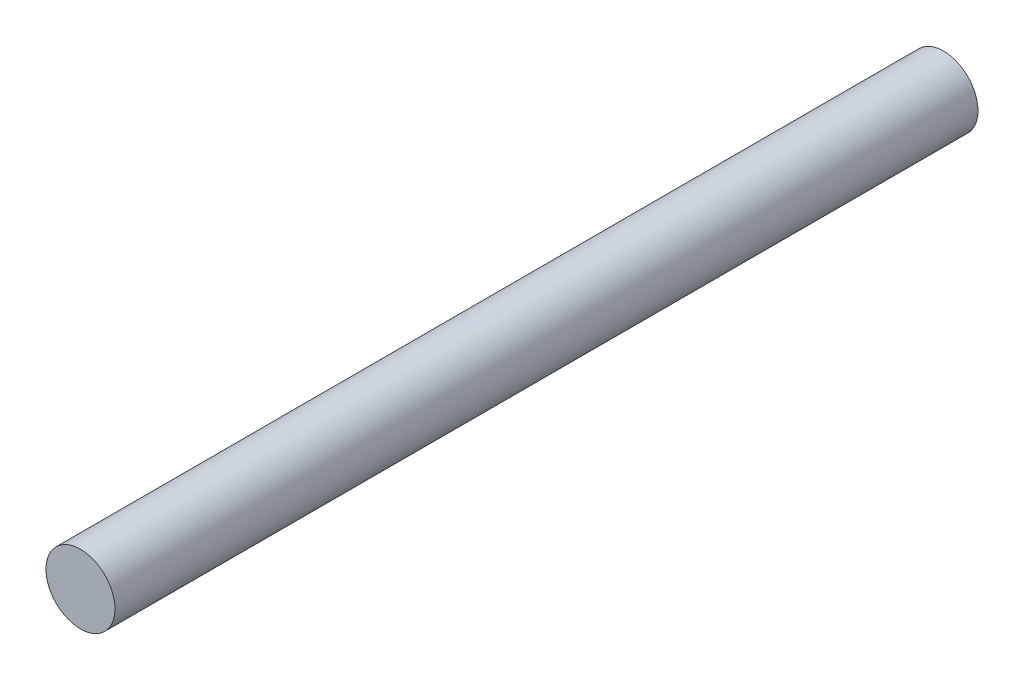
from build123d import *

# Parameters (mm, degrees)
SKETCH1_R           = 30
BOSS_EXTRUDE1_DEPTH = 750


with BuildPart() as part:
    # Sketch1 → Boss-Extrude1 (new body)
    with BuildSketch(Plane.XY):
        Circle(SKETCH1_R)
    extrude(amount=-BOSS_EXTRUDE1_DEPTH)


solid = part.part
